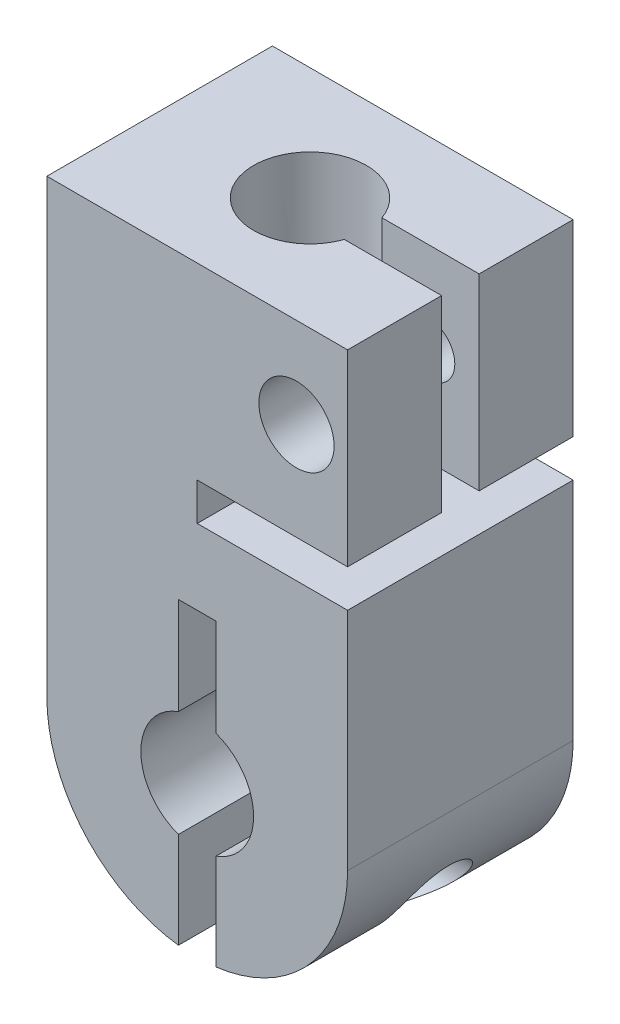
from build123d import *

# Parameters (mm, degrees)
SKETCH1_R             = 2.38125
EXTRUDE1_DEPTH        = 9.525
SKETCH2_W             = 1.5875
SKETCH2_H             = 16.57009416
CUT_EXTRUDE1_DEPTH    = 23.225
SKETCH3_W             = 1.1303
SKETCH3_H             = 5.55625
SKETCH7_W             = 1.63195
SKETCH7_H             = 5.55625
CUT_EXTRUDE2_DEPTH    = 9.525
SKETCH12_W            = 6.35
SKETCH12_H            = 1.5875
CUT_EXTRUDE3_DEPTH    = 23.225000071
F_4_40_TAPPED_HOLE3_D = 2.2606
CUT_EXTRUDE4_REACH    = 24.225
SKETCH15_R            = 1.5875


with BuildPart() as part:
    # Sketch1 → Extrude1 (new body)
    with BuildSketch(Plane.XY):
        with BuildLine():
            Line((-6.35, 0), (-6.35, 19.05))
            Line((-6.35, 19.05), (6.35, 19.05))
            Line((6.35, 19.05), (6.35, 0))
            ThreePointArc((6.35, 0), (0, -6.35), (-6.35, 0))
        make_face()
        with Locations(Location((0, 0, 0), (0, 0, 180))):
            Circle(SKETCH1_R, mode=Mode.SUBTRACT)
    extrude(amount=EXTRUDE1_DEPTH)

    # Sketch2 → Cut-Extrude1 (cut, through all)
    with BuildSketch(Plane.XY.offset(9.525)):
        with Locations((0, -1.93504708)):
            Rectangle(SKETCH2_W, SKETCH2_H)
    extrude(amount=-CUT_EXTRUDE1_DEPTH, mode=Mode.SUBTRACT)

    # Sketch3 → 4-40 Tapped Hole1 (revolve, cut)
    with BuildSketch(Plane(origin=(-0.79375, -4.064, 4.7625), x_dir=(0, 0, -1), z_dir=(0, 1, 0))):
        with Locations((0.56515, 2.778125)):
            Rectangle(SKETCH3_W, SKETCH3_H)
    revolve(axis=Axis((5.55625, -4.064, 4.7625), (-1, 0, 0)), mode=Mode.SUBTRACT)

    # Sketch7 → 4 Clearance Hole1 (revolve, cut)
    with BuildSketch(Plane(origin=(0.79375, -4.064, 4.7625), x_dir=(0, 0, 1), z_dir=(0, 1, 0))):
        with Locations((0.815975, 2.778125)):
            Rectangle(SKETCH7_W, SKETCH7_H)
    revolve(axis=Axis((-5.55625, -4.064, 4.7625), (1, 0, 0)), mode=Mode.SUBTRACT)

    # Sketch11 → Cut-Extrude2 (cut)
    with BuildSketch(Plane(origin=(0, 19.05, 0), x_dir=(-1, 0, 0), z_dir=(0, 1, 0))):
        with BuildLine():
            Line((-6.35, 3.96875), (-2.24506403, 3.96875))
            ThreePointArc((-2.24506403, 3.96875), (2.38125, 4.7625), (-2.24506403, 5.55625))
            Line((-2.24506403, 5.55625), (-6.35, 5.55625))
            Line((-6.35, 5.55625), (-6.35, 3.96875))
        make_face()
    extrude(amount=-CUT_EXTRUDE2_DEPTH, mode=Mode.SUBTRACT)

    # Sketch12 → Cut-Extrude3 (cut, through all)
    with BuildSketch(Plane(origin=(0, 0, 0), x_dir=(-1, 0, 0), z_dir=(0, 0, -1))):
        with Locations((-3.175, 10.31875)):
            Rectangle(SKETCH12_W, SKETCH12_H)
    extrude(amount=-CUT_EXTRUDE3_DEPTH, mode=Mode.SUBTRACT)

    # 4-40 Tapped Hole3 (through all)
    with Locations(Plane.XY.offset(9.525)):
        with Locations((4.191, 15.24)):
            Hole(F_4_40_TAPPED_HOLE3_D / 2)

    # Sketch15 → Cut-Extrude4 (cut, up to next)
    with BuildSketch(Plane.XY.offset(9.525), mode=Mode.PRIVATE) as cut_extrude4_sk1:
        with Locations((4.191, 15.24)):
            Circle(SKETCH15_R)
    cut_extrude4_tool1 = extrude(cut_extrude4_sk1.sketch, amount=-CUT_EXTRUDE4_REACH, mode=Mode.PRIVATE) & part.part
    add(cut_extrude4_tool1.solids().sort_by_distance((4.191, 15.24, 9.525))[0], mode=Mode.SUBTRACT)


solid = part.part
